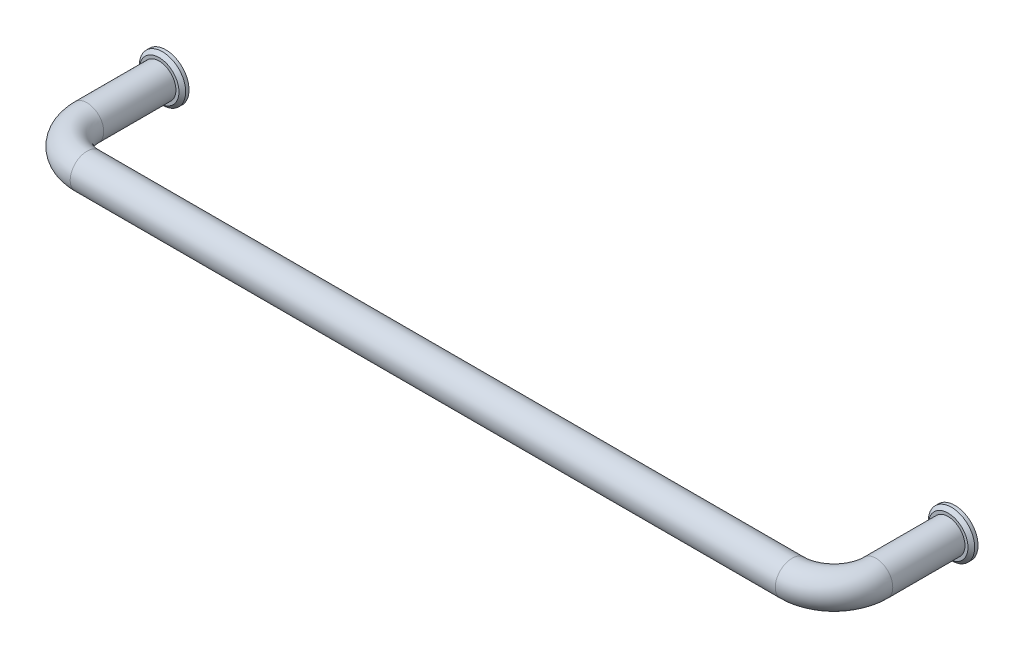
ISO-10303-21;
HEADER;
FILE_DESCRIPTION(('STEP AP214'),'2;1');
FILE_NAME('part.step','',(''),(''),'','','');
FILE_SCHEMA(('AUTOMOTIVE_DESIGN { 1 0 10303 214 1 1 1 1 }'));
ENDSEC;
DATA;
#1=APPLICATION_CONTEXT('core data for automotive mechanical design processes');
#2=APPLICATION_PROTOCOL_DEFINITION('international standard','automotive_design',2000,#1);
#3=PRODUCT_CONTEXT('',#1,'mechanical');
#4=PRODUCT('Part','Part','',(#3));
#5=PRODUCT_RELATED_PRODUCT_CATEGORY('part','',(#4));
#6=PRODUCT_DEFINITION_FORMATION('','',#4);
#7=PRODUCT_DEFINITION_CONTEXT('part definition',#1,'design');
#8=PRODUCT_DEFINITION('design','',#6,#7);
#9=PRODUCT_DEFINITION_SHAPE('','',#8);
#10=(LENGTH_UNIT() NAMED_UNIT(*) SI_UNIT(.MILLI.,.METRE.));
#11=(NAMED_UNIT(*) PLANE_ANGLE_UNIT() SI_UNIT($,.RADIAN.));
#12=(NAMED_UNIT(*) SI_UNIT($,.STERADIAN.) SOLID_ANGLE_UNIT());
#13=UNCERTAINTY_MEASURE_WITH_UNIT(LENGTH_MEASURE(1.E-05),#10,'distance_accuracy_value','');
#14=(GEOMETRIC_REPRESENTATION_CONTEXT(3) GLOBAL_UNCERTAINTY_ASSIGNED_CONTEXT((#13)) GLOBAL_UNIT_ASSIGNED_CONTEXT((#10,
#11,#12)) REPRESENTATION_CONTEXT('',''));
#15=CARTESIAN_POINT('',(0.,0.,0.));
#16=DIRECTION('',(0.,0.,1.));
#17=DIRECTION('',(1.,0.,0.));
#18=AXIS2_PLACEMENT_3D('',#15,#16,#17);
#19=CARTESIAN_POINT('',(0.,0.,0.));
#20=DIRECTION('',(0.,0.,1.));
#21=DIRECTION('',(0.,1.,0.));
#22=AXIS2_PLACEMENT_3D('',#19,#20,#21);
#23=PLANE('',#22);
#24=CARTESIAN_POINT('',(0.,0.,0.));
#25=DIRECTION('',(0.,0.,1.));
#26=DIRECTION('',(1.,0.,0.));
#27=AXIS2_PLACEMENT_3D('',#24,#25,#26);
#28=CIRCLE('',#27,6.9);
#29=CARTESIAN_POINT('',(6.9,0.,0.));
#30=VERTEX_POINT('',#29);
#31=EDGE_CURVE('E30',#30,#30,#28,.T.);
#32=ORIENTED_EDGE('',*,*,#31,.F.);
#33=EDGE_LOOP('',(#32));
#34=FACE_BOUND('',#33,.T.);
#35=CARTESIAN_POINT('',(0.,0.,0.));
#36=DIRECTION('',(0.,0.,1.));
#37=DIRECTION('',(0.,1.,0.));
#38=AXIS2_PLACEMENT_3D('',#35,#36,#37);
#39=CIRCLE('',#38,2.5);
#40=CARTESIAN_POINT('',(0.,2.5,0.));
#41=VERTEX_POINT('',#40);
#42=EDGE_CURVE('E16',#41,#41,#39,.F.);
#43=ORIENTED_EDGE('',*,*,#42,.F.);
#44=EDGE_LOOP('',(#43));
#45=FACE_BOUND('',#44,.T.);
#46=ADVANCED_FACE('F12',(#34,#45),#23,.F.);
#47=CARTESIAN_POINT('',(0.,0.,23.5));
#48=DIRECTION('',(0.,0.,-1.));
#49=DIRECTION('',(-1.,0.,0.));
#50=AXIS2_PLACEMENT_3D('',#47,#48,#49);
#51=CYLINDRICAL_SURFACE('',#50,5.);
#52=CARTESIAN_POINT('',(0.,0.,23.5));
#53=DIRECTION('',(0.,0.,1.));
#54=DIRECTION('',(0.,1.,0.));
#55=AXIS2_PLACEMENT_3D('',#52,#53,#54);
#56=CIRCLE('',#55,5.);
#57=CARTESIAN_POINT('',(-5.,0.,23.5));
#58=VERTEX_POINT('',#57);
#59=EDGE_CURVE('E51',#58,#58,#56,.T.);
#60=ORIENTED_EDGE('',*,*,#59,.F.);
#61=EDGE_LOOP('',(#60));
#62=FACE_BOUND('',#61,.T.);
#63=CARTESIAN_POINT('',(0.,0.,2.00000000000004));
#64=DIRECTION('',(0.,0.,-1.));
#65=DIRECTION('',(-1.,0.,0.));
#66=AXIS2_PLACEMENT_3D('',#63,#64,#65);
#67=CIRCLE('',#66,5.);
#68=CARTESIAN_POINT('',(-5.,0.,2.00000000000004));
#69=VERTEX_POINT('',#68);
#70=EDGE_CURVE('E25',#69,#69,#67,.T.);
#71=ORIENTED_EDGE('',*,*,#70,.F.);
#72=EDGE_LOOP('',(#71));
#73=FACE_BOUND('',#72,.T.);
#74=ADVANCED_FACE('F75',(#62,#73),#51,.T.);
#75=CARTESIAN_POINT('',(235.,0.,23.5));
#76=DIRECTION('',(0.,0.,-1.));
#77=DIRECTION('',(0.,-1.,0.));
#78=AXIS2_PLACEMENT_3D('',#75,#76,#77);
#79=CYLINDRICAL_SURFACE('',#78,5.);
#80=CARTESIAN_POINT('',(235.,0.,23.5));
#81=DIRECTION('',(0.,0.,-1.));
#82=DIRECTION('',(0.,1.,0.));
#83=AXIS2_PLACEMENT_3D('',#80,#81,#82);
#84=CIRCLE('',#83,5.);
#85=CARTESIAN_POINT('',(240.,0.,23.5));
#86=VERTEX_POINT('',#85);
#87=EDGE_CURVE('E60',#86,#86,#84,.T.);
#88=ORIENTED_EDGE('',*,*,#87,.T.);
#89=EDGE_LOOP('',(#88));
#90=FACE_BOUND('',#89,.T.);
#91=CARTESIAN_POINT('',(235.,0.,1.99999999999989));
#92=DIRECTION('',(0.,0.,-1.));
#93=DIRECTION('',(-1.,0.,0.));
#94=AXIS2_PLACEMENT_3D('',#91,#92,#93);
#95=CIRCLE('',#94,5.);
#96=CARTESIAN_POINT('',(230.,0.,1.99999999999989));
#97=VERTEX_POINT('',#96);
#98=EDGE_CURVE('E50',#97,#97,#95,.F.);
#99=ORIENTED_EDGE('',*,*,#98,.T.);
#100=EDGE_LOOP('',(#99));
#101=FACE_BOUND('',#100,.T.);
#102=ADVANCED_FACE('F14',(#90,#101),#79,.T.);
#103=CARTESIAN_POINT('',(222.5,0.,23.5));
#104=DIRECTION('',(0.,1.,0.));
#105=DIRECTION('',(-1.,0.,0.));
#106=AXIS2_PLACEMENT_3D('',#103,#104,#105);
#107=TOROIDAL_SURFACE('',#106,12.5,5.);
#108=CARTESIAN_POINT('',(222.5,0.,36.));
#109=DIRECTION('',(1.,0.,0.));
#110=DIRECTION('',(0.,1.,0.));
#111=AXIS2_PLACEMENT_3D('',#108,#109,#110);
#112=CIRCLE('',#111,5.);
#113=CARTESIAN_POINT('',(222.5,0.,41.));
#114=VERTEX_POINT('',#113);
#115=EDGE_CURVE('E57',#114,#114,#112,.T.);
#116=CARTESIAN_POINT('',(222.5,0.,23.5));
#117=DIRECTION('',(0.,1.,0.));
#118=DIRECTION('',(-1.,0.,0.));
#119=AXIS2_PLACEMENT_3D('',#116,#117,#118);
#120=CIRCLE('',#119,17.5);
#121=EDGE_CURVE('',#114,#86,#120,.T.);
#122=ORIENTED_EDGE('',*,*,#115,.T.);
#123=ORIENTED_EDGE('',*,*,#87,.F.);
#124=ORIENTED_EDGE('',*,*,#121,.T.);
#125=ORIENTED_EDGE('',*,*,#121,.F.);
#126=EDGE_LOOP('',(#122,#124,#123,#125));
#127=FACE_BOUND('',#126,.T.);
#128=ADVANCED_FACE('F85',(#127),#107,.T.);
#129=CARTESIAN_POINT('',(12.5,0.,36.));
#130=DIRECTION('',(1.,0.,0.));
#131=DIRECTION('',(0.,0.,-1.));
#132=AXIS2_PLACEMENT_3D('',#129,#130,#131);
#133=CYLINDRICAL_SURFACE('',#132,5.);
#134=CARTESIAN_POINT('',(12.5,0.,36.));
#135=DIRECTION('',(1.,0.,0.));
#136=DIRECTION('',(0.,1.,0.));
#137=AXIS2_PLACEMENT_3D('',#134,#135,#136);
#138=CIRCLE('',#137,5.);
#139=CARTESIAN_POINT('',(12.5,0.,41.));
#140=VERTEX_POINT('',#139);
#141=EDGE_CURVE('E54',#140,#140,#138,.T.);
#142=ORIENTED_EDGE('',*,*,#141,.T.);
#143=EDGE_LOOP('',(#142));
#144=FACE_BOUND('',#143,.T.);
#145=ORIENTED_EDGE('',*,*,#115,.F.);
#146=EDGE_LOOP('',(#145));
#147=FACE_BOUND('',#146,.T.);
#148=ADVANCED_FACE('F97',(#144,#147),#133,.T.);
#149=CARTESIAN_POINT('',(12.5,0.,23.5));
#150=DIRECTION('',(0.,1.,0.));
#151=DIRECTION('',(-1.,0.,0.));
#152=AXIS2_PLACEMENT_3D('',#149,#150,#151);
#153=TOROIDAL_SURFACE('',#152,12.5,5.);
#154=CARTESIAN_POINT('',(12.5,0.,23.5));
#155=DIRECTION('',(0.,1.,0.));
#156=DIRECTION('',(-1.,0.,0.));
#157=AXIS2_PLACEMENT_3D('',#154,#155,#156);
#158=CIRCLE('',#157,17.5);
#159=EDGE_CURVE('',#58,#140,#158,.T.);
#160=ORIENTED_EDGE('',*,*,#59,.T.);
#161=ORIENTED_EDGE('',*,*,#141,.F.);
#162=ORIENTED_EDGE('',*,*,#159,.T.);
#163=ORIENTED_EDGE('',*,*,#159,.F.);
#164=EDGE_LOOP('',(#160,#162,#161,#163));
#165=FACE_BOUND('',#164,.T.);
#166=ADVANCED_FACE('F93',(#165),#153,.T.);
#167=CARTESIAN_POINT('',(235.,0.,1.99999999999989));
#168=DIRECTION('',(0.,0.,-1.));
#169=DIRECTION('',(-1.,0.,0.));
#170=AXIS2_PLACEMENT_3D('',#167,#168,#169);
#171=CYLINDRICAL_SURFACE('',#170,6.9);
#172=CARTESIAN_POINT('',(235.,0.,0.99999999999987));
#173=DIRECTION('',(0.,0.,-1.));
#174=DIRECTION('',(0.,-1.,0.));
#175=AXIS2_PLACEMENT_3D('',#172,#173,#174);
#176=CIRCLE('',#175,6.9);
#177=CARTESIAN_POINT('',(235.,-6.9,0.99999999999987));
#178=VERTEX_POINT('',#177);
#179=EDGE_CURVE('E63',#178,#178,#176,.T.);
#180=ORIENTED_EDGE('',*,*,#179,.T.);
#181=EDGE_LOOP('',(#180));
#182=FACE_BOUND('',#181,.T.);
#183=CARTESIAN_POINT('',(235.,0.,-1.11208082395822E-13));
#184=DIRECTION('',(0.,0.,-1.));
#185=DIRECTION('',(-1.,0.,0.));
#186=AXIS2_PLACEMENT_3D('',#183,#184,#185);
#187=CIRCLE('',#186,6.9);
#188=CARTESIAN_POINT('',(228.1,0.,-1.09131366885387E-13));
#189=VERTEX_POINT('',#188);
#190=EDGE_CURVE('E34',#189,#189,#187,.T.);
#191=ORIENTED_EDGE('',*,*,#190,.F.);
#192=EDGE_LOOP('',(#191));
#193=FACE_BOUND('',#192,.T.);
#194=ADVANCED_FACE('F96',(#182,#193),#171,.T.);
#195=CARTESIAN_POINT('',(235.,0.,1.99999999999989));
#196=DIRECTION('',(0.,0.,-1.));
#197=DIRECTION('',(-1.,0.,0.));
#198=AXIS2_PLACEMENT_3D('',#195,#196,#197);
#199=PLANE('',#198);
#200=CARTESIAN_POINT('',(235.,0.,1.99999999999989));
#201=DIRECTION('',(0.,0.,-1.));
#202=DIRECTION('',(-1.,0.,0.));
#203=AXIS2_PLACEMENT_3D('',#200,#201,#202);
#204=CIRCLE('',#203,5.9);
#205=CARTESIAN_POINT('',(229.1,0.,1.99999999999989));
#206=VERTEX_POINT('',#205);
#207=EDGE_CURVE('E68',#206,#206,#204,.F.);
#208=ORIENTED_EDGE('',*,*,#207,.T.);
#209=EDGE_LOOP('',(#208));
#210=FACE_BOUND('',#209,.T.);
#211=ORIENTED_EDGE('',*,*,#98,.F.);
#212=EDGE_LOOP('',(#211));
#213=FACE_BOUND('',#212,.T.);
#214=ADVANCED_FACE('F112',(#210,#213),#199,.F.);
#215=CARTESIAN_POINT('',(235.,0.,-1.2740131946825E-13));
#216=DIRECTION('',(0.,0.,-1.));
#217=DIRECTION('',(0.,1.,0.));
#218=AXIS2_PLACEMENT_3D('',#215,#216,#217);
#219=PLANE('',#218);
#220=CARTESIAN_POINT('',(235.,0.,-1.2740131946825E-13));
#221=DIRECTION('',(0.,0.,-1.));
#222=DIRECTION('',(-1.,0.,0.));
#223=AXIS2_PLACEMENT_3D('',#220,#221,#222);
#224=CIRCLE('',#223,2.5);
#225=CARTESIAN_POINT('',(232.5,0.,-1.26648886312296E-13));
#226=VERTEX_POINT('',#225);
#227=EDGE_CURVE('E28',#226,#226,#224,.T.);
#228=ORIENTED_EDGE('',*,*,#227,.F.);
#229=EDGE_LOOP('',(#228));
#230=FACE_BOUND('',#229,.T.);
#231=ORIENTED_EDGE('',*,*,#190,.T.);
#232=EDGE_LOOP('',(#231));
#233=FACE_BOUND('',#232,.T.);
#234=ADVANCED_FACE('F92',(#230,#233),#219,.T.);
#235=CARTESIAN_POINT('',(235.,0.,0.99999999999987));
#236=DIRECTION('',(0.,0.,-1.));
#237=DIRECTION('',(0.,-1.,0.));
#238=AXIS2_PLACEMENT_3D('',#235,#236,#237);
#239=CONICAL_SURFACE('',#238,6.9,0.785398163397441);
#240=ORIENTED_EDGE('',*,*,#207,.F.);
#241=EDGE_LOOP('',(#240));
#242=FACE_BOUND('',#241,.T.);
#243=ORIENTED_EDGE('',*,*,#179,.F.);
#244=EDGE_LOOP('',(#243));
#245=FACE_BOUND('',#244,.T.);
#246=ADVANCED_FACE('F121',(#242,#245),#239,.T.);
#247=CARTESIAN_POINT('',(0.,0.,2.00000000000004));
#248=DIRECTION('',(0.,0.,-1.));
#249=DIRECTION('',(1.,0.,0.));
#250=AXIS2_PLACEMENT_3D('',#247,#248,#249);
#251=PLANE('',#250);
#252=CARTESIAN_POINT('',(0.,0.,2.00000000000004));
#253=DIRECTION('',(0.,0.,-1.));
#254=DIRECTION('',(-1.,0.,0.));
#255=AXIS2_PLACEMENT_3D('',#252,#253,#254);
#256=CIRCLE('',#255,5.9);
#257=CARTESIAN_POINT('',(-5.9,0.,2.00000000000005));
#258=VERTEX_POINT('',#257);
#259=EDGE_CURVE('E20',#258,#258,#256,.F.);
#260=ORIENTED_EDGE('',*,*,#259,.T.);
#261=EDGE_LOOP('',(#260));
#262=FACE_BOUND('',#261,.T.);
#263=ORIENTED_EDGE('',*,*,#70,.T.);
#264=EDGE_LOOP('',(#263));
#265=FACE_BOUND('',#264,.T.);
#266=ADVANCED_FACE('F73',(#262,#265),#251,.F.);
#267=CARTESIAN_POINT('',(0.,0.,2.00000000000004));
#268=DIRECTION('',(0.,0.,-1.));
#269=DIRECTION('',(-1.,0.,0.));
#270=AXIS2_PLACEMENT_3D('',#267,#268,#269);
#271=CYLINDRICAL_SURFACE('',#270,6.9);
#272=CARTESIAN_POINT('',(0.,0.,1.00000000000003));
#273=DIRECTION('',(0.,0.,-1.));
#274=DIRECTION('',(0.,-1.,0.));
#275=AXIS2_PLACEMENT_3D('',#272,#273,#274);
#276=CIRCLE('',#275,6.9);
#277=CARTESIAN_POINT('',(0.,-6.9,1.00000000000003));
#278=VERTEX_POINT('',#277);
#279=EDGE_CURVE('E8',#278,#278,#276,.T.);
#280=ORIENTED_EDGE('',*,*,#279,.T.);
#281=EDGE_LOOP('',(#280));
#282=FACE_BOUND('',#281,.T.);
#283=ORIENTED_EDGE('',*,*,#31,.T.);
#284=EDGE_LOOP('',(#283));
#285=FACE_BOUND('',#284,.T.);
#286=ADVANCED_FACE('F129',(#282,#285),#271,.T.);
#287=CARTESIAN_POINT('',(0.,0.,2.00000000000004));
#288=DIRECTION('',(0.,0.,-1.));
#289=DIRECTION('',(0.,-1.,0.));
#290=AXIS2_PLACEMENT_3D('',#287,#288,#289);
#291=CONICAL_SURFACE('',#290,5.9,0.785398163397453);
#292=ORIENTED_EDGE('',*,*,#279,.F.);
#293=EDGE_LOOP('',(#292));
#294=FACE_BOUND('',#293,.T.);
#295=ORIENTED_EDGE('',*,*,#259,.F.);
#296=EDGE_LOOP('',(#295));
#297=FACE_BOUND('',#296,.T.);
#298=ADVANCED_FACE('F132',(#294,#297),#291,.T.);
#299=CARTESIAN_POINT('',(235.,0.,-8.00000000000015));
#300=DIRECTION('',(0.,0.,1.));
#301=DIRECTION('',(1.,0.,0.));
#302=AXIS2_PLACEMENT_3D('',#299,#300,#301);
#303=CYLINDRICAL_SURFACE('',#302,2.5);
#304=ORIENTED_EDGE('',*,*,#227,.T.);
#305=EDGE_LOOP('',(#304));
#306=FACE_BOUND('',#305,.T.);
#307=CARTESIAN_POINT('',(235.,0.,10.9999999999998));
#308=DIRECTION('',(0.,0.,-1.));
#309=DIRECTION('',(-1.,0.,0.));
#310=AXIS2_PLACEMENT_3D('',#307,#308,#309);
#311=CIRCLE('',#310,2.5);
#312=CARTESIAN_POINT('',(232.5,0.,10.9999999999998));
#313=VERTEX_POINT('',#312);
#314=EDGE_CURVE('E41',#313,#313,#311,.T.);
#315=ORIENTED_EDGE('',*,*,#314,.F.);
#316=EDGE_LOOP('',(#315));
#317=FACE_BOUND('',#316,.T.);
#318=ADVANCED_FACE('F138',(#306,#317),#303,.F.);
#319=CARTESIAN_POINT('',(0.,0.,-8.));
#320=DIRECTION('',(0.,0.,1.));
#321=DIRECTION('',(1.,0.,0.));
#322=AXIS2_PLACEMENT_3D('',#319,#320,#321);
#323=CYLINDRICAL_SURFACE('',#322,2.5);
#324=ORIENTED_EDGE('',*,*,#42,.T.);
#325=EDGE_LOOP('',(#324));
#326=FACE_BOUND('',#325,.T.);
#327=CARTESIAN_POINT('',(0.,0.,11.));
#328=DIRECTION('',(0.,0.,-1.));
#329=DIRECTION('',(-1.,0.,0.));
#330=AXIS2_PLACEMENT_3D('',#327,#328,#329);
#331=CIRCLE('',#330,2.5);
#332=CARTESIAN_POINT('',(-2.49999999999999,0.,11.));
#333=VERTEX_POINT('',#332);
#334=EDGE_CURVE('E37',#333,#333,#331,.T.);
#335=ORIENTED_EDGE('',*,*,#334,.F.);
#336=EDGE_LOOP('',(#335));
#337=FACE_BOUND('',#336,.T.);
#338=ADVANCED_FACE('F142',(#326,#337),#323,.F.);
#339=CARTESIAN_POINT('',(0.,0.,11.));
#340=DIRECTION('',(0.,0.,-1.));
#341=DIRECTION('',(-1.,0.,0.));
#342=AXIS2_PLACEMENT_3D('',#339,#340,#341);
#343=PLANE('',#342);
#344=ORIENTED_EDGE('',*,*,#334,.T.);
#345=EDGE_LOOP('',(#344));
#346=FACE_BOUND('',#345,.T.);
#347=ADVANCED_FACE('F145',(#346),#343,.T.);
#348=CARTESIAN_POINT('',(235.,0.,10.9999999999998));
#349=DIRECTION('',(0.,0.,-1.));
#350=DIRECTION('',(-1.,0.,0.));
#351=AXIS2_PLACEMENT_3D('',#348,#349,#350);
#352=PLANE('',#351);
#353=ORIENTED_EDGE('',*,*,#314,.T.);
#354=EDGE_LOOP('',(#353));
#355=FACE_BOUND('',#354,.T.);
#356=ADVANCED_FACE('F148',(#355),#352,.T.);
#357=CLOSED_SHELL('',(#46,#74,#102,#128,#148,#166,#194,#214,#234,#246,#266,#286,#298,#318,#338,
#347,#356));
#358=MANIFOLD_SOLID_BREP('B1',#357);
#359=ADVANCED_BREP_SHAPE_REPRESENTATION('',(#18,#358),#14);
#360=SHAPE_DEFINITION_REPRESENTATION(#9,#359);
ENDSEC;
END-ISO-10303-21;
